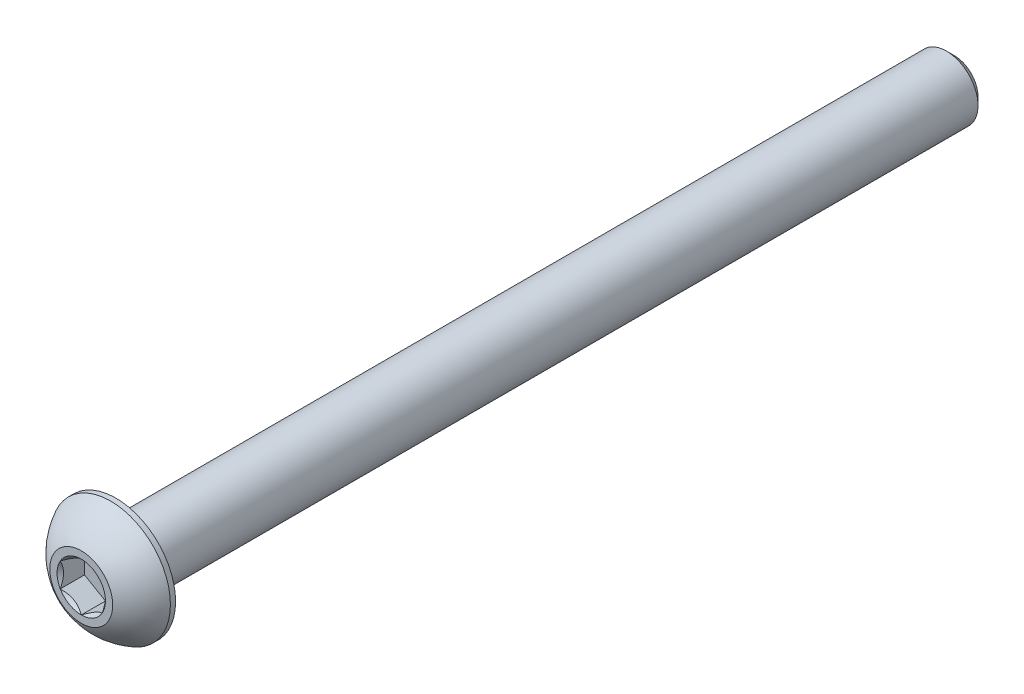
from build123d import *

# Parameters (mm, degrees)
SKETCH1_W          = 40
SKETCH1_H          = 1.5
CHAMFER1_SIZE      = 0.375
CUT_EXTRUDE2_DEPTH = 1.155


with BuildPart() as part:
    # Sketch1 → Revolve1 (revolve)
    with BuildSketch(Plane(origin=(0, 0, 0), x_dir=(0, 0, -1), z_dir=(1, 0, 0))):
        with Locations((21.65, 0.75)):
            Rectangle(SKETCH1_W, SKETCH1_H)
    revolve(axis=Axis((0, 0, -41.65), (0, 0, 1)))

    # Chamfer1
    chamfer1_edges = [part.edges().sort_by_distance(p)[0] for p in [
        (0, -1.5, -41.65),
    ]]
    chamfer(chamfer1_edges, length=CHAMFER1_SIZE)

    # Sketch7 → Revolve2 (revolve)
    with BuildSketch(Plane(origin=(0, 0, 0), x_dir=(0, 0, -1), z_dir=(1, 0, 0)), mode=Mode.PRIVATE) as revolve2_sk:
        with BuildLine():
            Line((1.4025, 2.85), (1.65, 2.85))
            Line((1.65, 2.85), (1.65, 0))
            Line((1.65, 0), (0, 0))
            Line((0, 0), (0, 1.5))
            ThreePointArc((0, 1.5), (0.59512511, 2.285251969), (1.4025, 2.85))
        make_face()
    revolve(revolve2_sk.sketch.rotate(Axis((0, 0, 0), (0, 0, -1)), 180), axis=Axis((0, 0, 0), (0, 0, -1)))

    # Sketch5 → Cut-Extrude2 (cut)
    with BuildSketch(Plane.XY):
        Polygon((1, -0.577350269), (1, 0.577350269), (0, 1.154700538), (-1, 0.577350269), (-1, -0.577350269), (0, -1.154700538), align=None)
    extrude(amount=-CUT_EXTRUDE2_DEPTH, mode=Mode.SUBTRACT)

    # Cut-Extrude3 cone 1 section (on through the dimple's axis) → Cut-Extrude3 (revolve, cut)
    with BuildSketch(Plane(origin=(0, 0, 0), x_dir=(0, -1, 0), z_dir=(1, 0, 0))):
        Polygon((0, 0), (1.154700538, 0), (0, 1.154700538), align=None)
    revolve(axis=Axis((0, 0, 0), (0, 0, -1)), mode=Mode.SUBTRACT)


solid = part.part
